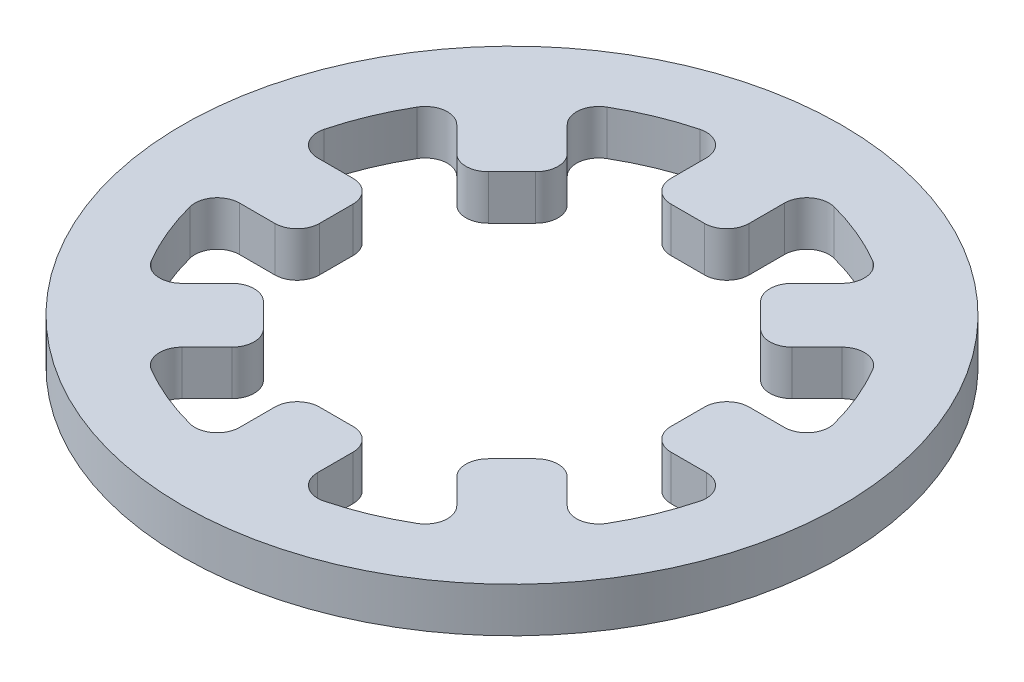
from build123d import *

# Parameters (mm, degrees)
SKETCH1_R           = 7.5
BOSS_EXTRUDE1_DEPTH = 1.016


with BuildPart() as part:
    # Sketch1 → Boss-Extrude1 (new body)
    with BuildSketch(Plane(origin=(0, 0, 0), x_dir=(1, 0, 0), z_dir=(0, 1, 0))):
        with Locations(Location((0, 0, 0), (0, 0, 270))):
            Circle(SKETCH1_R)
        with BuildLine():
            Line((-0.889, 5.311351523), (-0.889, 4.508))
            ThreePointArc((-0.889, 4.508), (-0.740210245, 4.148789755), (-0.381, 4))
            Line((-0.381, 4), (0.381, 4))
            ThreePointArc((0.381, 4), (0.740210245, 4.148789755), (0.889, 4.508))
            Line((0.889, 4.508), (0.889, 5.311351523))
            ThreePointArc((0.889, 5.311351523), (1.08682242, 5.713662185), (1.526219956, 5.802641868))
            ThreePointArc((1.526219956, 5.802641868), (2.296100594, 5.543277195), (3.023886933, 5.182287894))
            ThreePointArc((3.023886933, 5.182287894), (3.271669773, 4.80866878), (3.127074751, 4.384310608))
            Line((3.127074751, 4.384310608), (2.559019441, 3.816255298))
            ThreePointArc((2.559019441, 3.816255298), (2.410229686, 3.457045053), (2.559019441, 3.097834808))
            Line((2.559019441, 3.097834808), (3.097834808, 2.559019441))
            ThreePointArc((3.097834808, 2.559019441), (3.457045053, 2.410229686), (3.816255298, 2.559019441))
            Line((3.816255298, 2.559019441), (4.384310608, 3.127074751))
            ThreePointArc((4.384310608, 3.127074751), (4.80866878, 3.271669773), (5.182287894, 3.023886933))
            ThreePointArc((5.182287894, 3.023886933), (5.543277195, 2.296100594), (5.802641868, 1.526219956))
            ThreePointArc((5.802641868, 1.526219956), (5.713662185, 1.08682242), (5.311351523, 0.889))
            Line((5.311351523, 0.889), (4.508, 0.889))
            ThreePointArc((4.508, 0.889), (4.148789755, 0.740210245), (4, 0.381))
            Line((4, 0.381), (4, -0.381))
            ThreePointArc((4, -0.381), (4.148789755, -0.740210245), (4.508, -0.889))
            Line((4.508, -0.889), (5.311351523, -0.889))
            ThreePointArc((5.311351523, -0.889), (5.713662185, -1.08682242), (5.802641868, -1.526219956))
            ThreePointArc((5.802641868, -1.526219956), (5.543277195, -2.296100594), (5.182287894, -3.023886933))
            ThreePointArc((5.182287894, -3.023886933), (4.80866878, -3.271669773), (4.384310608, -3.127074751))
            Line((4.384310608, -3.127074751), (3.816255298, -2.559019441))
            ThreePointArc((3.816255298, -2.559019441), (3.457045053, -2.410229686), (3.097834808, -2.559019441))
            Line((3.097834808, -2.559019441), (2.559019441, -3.097834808))
            ThreePointArc((2.559019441, -3.097834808), (2.410229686, -3.457045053), (2.559019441, -3.816255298))
            Line((2.559019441, -3.816255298), (3.127074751, -4.384310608))
            ThreePointArc((3.127074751, -4.384310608), (3.271669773, -4.80866878), (3.023886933, -5.182287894))
            ThreePointArc((3.023886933, -5.182287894), (2.296100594, -5.543277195), (1.526219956, -5.802641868))
            ThreePointArc((1.526219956, -5.802641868), (1.08682242, -5.713662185), (0.889, -5.311351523))
            Line((0.889, -5.311351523), (0.889, -4.508))
            ThreePointArc((0.889, -4.508), (0.740210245, -4.148789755), (0.381, -4))
            Line((0.381, -4), (-0.381, -4))
            ThreePointArc((-0.381, -4), (-0.740210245, -4.148789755), (-0.889, -4.508))
            Line((-0.889, -4.508), (-0.889, -5.311351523))
            ThreePointArc((-0.889, -5.311351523), (-1.08682242, -5.713662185), (-1.526219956, -5.802641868))
            ThreePointArc((-1.526219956, -5.802641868), (-2.296100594, -5.543277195), (-3.023886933, -5.182287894))
            ThreePointArc((-3.023886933, -5.182287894), (-3.271669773, -4.80866878), (-3.127074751, -4.384310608))
            Line((-3.127074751, -4.384310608), (-2.559019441, -3.816255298))
            ThreePointArc((-2.559019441, -3.816255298), (-2.410229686, -3.457045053), (-2.559019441, -3.097834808))
            Line((-2.559019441, -3.097834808), (-3.097834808, -2.559019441))
            ThreePointArc((-3.097834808, -2.559019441), (-3.457045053, -2.410229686), (-3.816255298, -2.559019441))
            Line((-3.816255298, -2.559019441), (-4.384310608, -3.127074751))
            ThreePointArc((-4.384310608, -3.127074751), (-4.80866878, -3.271669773), (-5.182287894, -3.023886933))
            ThreePointArc((-5.182287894, -3.023886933), (-5.543277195, -2.296100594), (-5.802641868, -1.526219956))
            ThreePointArc((-5.802641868, -1.526219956), (-5.713662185, -1.08682242), (-5.311351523, -0.889))
            Line((-5.311351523, -0.889), (-4.508, -0.889))
            ThreePointArc((-4.508, -0.889), (-4.148789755, -0.740210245), (-4, -0.381))
            Line((-4, -0.381), (-4, 0.381))
            ThreePointArc((-4, 0.381), (-4.148789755, 0.740210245), (-4.508, 0.889))
            Line((-4.508, 0.889), (-5.311351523, 0.889))
            ThreePointArc((-5.311351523, 0.889), (-5.713662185, 1.08682242), (-5.802641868, 1.526219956))
            ThreePointArc((-5.802641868, 1.526219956), (-5.543277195, 2.296100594), (-5.182287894, 3.023886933))
            ThreePointArc((-5.182287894, 3.023886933), (-4.80866878, 3.271669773), (-4.384310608, 3.127074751))
            Line((-4.384310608, 3.127074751), (-3.816255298, 2.559019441))
            ThreePointArc((-3.816255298, 2.559019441), (-3.457045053, 2.410229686), (-3.097834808, 2.559019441))
            Line((-3.097834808, 2.559019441), (-2.559019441, 3.097834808))
            ThreePointArc((-2.559019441, 3.097834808), (-2.410229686, 3.457045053), (-2.559019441, 3.816255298))
            Line((-2.559019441, 3.816255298), (-3.127074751, 4.384310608))
            ThreePointArc((-3.127074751, 4.384310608), (-3.271669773, 4.80866878), (-3.023886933, 5.182287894))
            ThreePointArc((-3.023886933, 5.182287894), (-2.296100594, 5.543277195), (-1.526219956, 5.802641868))
            ThreePointArc((-1.526219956, 5.802641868), (-1.08682242, 5.713662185), (-0.889, 5.311351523))
        make_face(mode=Mode.SUBTRACT)
    extrude(amount=BOSS_EXTRUDE1_DEPTH)


solid = part.part
